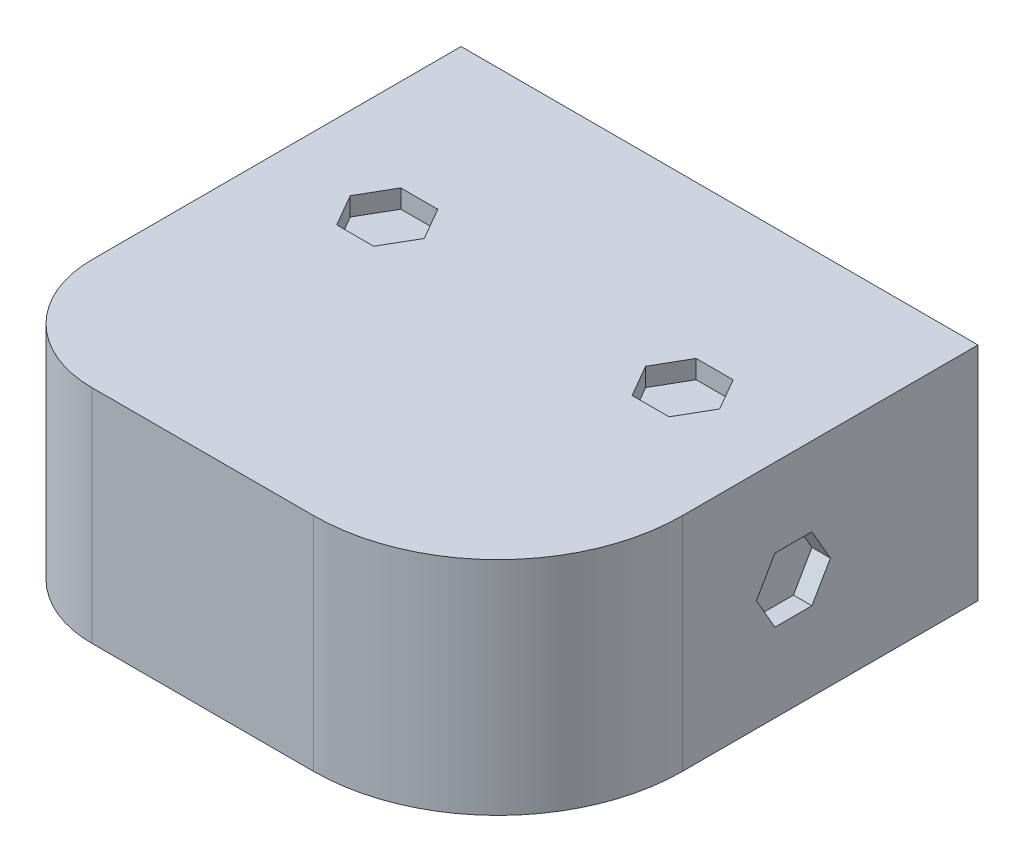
ISO-10303-21;
HEADER;
FILE_DESCRIPTION(('STEP AP214'),'2;1');
FILE_NAME('part.step','',(''),(''),'','','');
FILE_SCHEMA(('AUTOMOTIVE_DESIGN { 1 0 10303 214 1 1 1 1 }'));
ENDSEC;
DATA;
#1=APPLICATION_CONTEXT('core data for automotive mechanical design processes');
#2=APPLICATION_PROTOCOL_DEFINITION('international standard','automotive_design',2000,#1);
#3=PRODUCT_CONTEXT('',#1,'mechanical');
#4=PRODUCT('Part','Part','',(#3));
#5=PRODUCT_RELATED_PRODUCT_CATEGORY('part','',(#4));
#6=PRODUCT_DEFINITION_FORMATION('','',#4);
#7=PRODUCT_DEFINITION_CONTEXT('part definition',#1,'design');
#8=PRODUCT_DEFINITION('design','',#6,#7);
#9=PRODUCT_DEFINITION_SHAPE('','',#8);
#10=(LENGTH_UNIT() NAMED_UNIT(*) SI_UNIT(.MILLI.,.METRE.));
#11=(NAMED_UNIT(*) PLANE_ANGLE_UNIT() SI_UNIT($,.RADIAN.));
#12=(NAMED_UNIT(*) SI_UNIT($,.STERADIAN.) SOLID_ANGLE_UNIT());
#13=UNCERTAINTY_MEASURE_WITH_UNIT(LENGTH_MEASURE(1.E-05),#10,'distance_accuracy_value','');
#14=(GEOMETRIC_REPRESENTATION_CONTEXT(3) GLOBAL_UNCERTAINTY_ASSIGNED_CONTEXT((#13)) GLOBAL_UNIT_ASSIGNED_CONTEXT((#10,
#11,#12)) REPRESENTATION_CONTEXT('',''));
#15=CARTESIAN_POINT('',(0.,0.,0.));
#16=DIRECTION('',(0.,0.,1.));
#17=DIRECTION('',(1.,0.,0.));
#18=AXIS2_PLACEMENT_3D('',#15,#16,#17);
#19=CARTESIAN_POINT('',(88.9,38.1,-31.7500000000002));
#20=DIRECTION('',(-1.,0.,0.));
#21=DIRECTION('',(0.,0.,1.));
#22=AXIS2_PLACEMENT_3D('',#19,#20,#21);
#23=PLANE('',#22);
#24=DIRECTION('',(0.,-0.866025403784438,-0.500000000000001));
#25=VECTOR('',#24,1.);
#26=CARTESIAN_POINT('',(88.9,19.05,-44.4355215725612));
#27=LINE('',#26,#25);
#28=CARTESIAN_POINT('',(88.9,19.05,-44.4355215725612));
#29=VERTEX_POINT('',#28);
#30=CARTESIAN_POINT('',(88.9,13.5382,-47.6177607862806));
#31=VERTEX_POINT('',#30);
#32=EDGE_CURVE('E300',#29,#31,#27,.T.);
#33=ORIENTED_EDGE('',*,*,#32,.F.);
#34=DIRECTION('',(0.,-0.866025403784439,0.5));
#35=VECTOR('',#34,1.);
#36=CARTESIAN_POINT('',(88.9,24.5618,-47.6177607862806));
#37=LINE('',#36,#35);
#38=CARTESIAN_POINT('',(88.9,24.5618,-47.6177607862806));
#39=VERTEX_POINT('',#38);
#40=EDGE_CURVE('E47',#39,#29,#37,.T.);
#41=ORIENTED_EDGE('',*,*,#40,.F.);
#42=DIRECTION('',(0.,0.,1.));
#43=VECTOR('',#42,1.);
#44=CARTESIAN_POINT('',(88.9,24.5618,-53.9822392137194));
#45=LINE('',#44,#43);
#46=CARTESIAN_POINT('',(88.9,24.5618,-53.9822392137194));
#47=VERTEX_POINT('',#46);
#48=EDGE_CURVE('E286',#47,#39,#45,.T.);
#49=ORIENTED_EDGE('',*,*,#48,.F.);
#50=DIRECTION('',(0.,0.866025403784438,0.500000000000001));
#51=VECTOR('',#50,1.);
#52=CARTESIAN_POINT('',(88.9,19.05,-57.1644784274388));
#53=LINE('',#52,#51);
#54=CARTESIAN_POINT('',(88.9,19.05,-57.1644784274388));
#55=VERTEX_POINT('',#54);
#56=EDGE_CURVE('E289',#55,#47,#53,.T.);
#57=ORIENTED_EDGE('',*,*,#56,.F.);
#58=DIRECTION('',(0.,0.866025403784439,-0.499999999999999));
#59=VECTOR('',#58,1.);
#60=CARTESIAN_POINT('',(88.9,13.5382,-53.9822392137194));
#61=LINE('',#60,#59);
#62=CARTESIAN_POINT('',(88.9,13.5382,-53.9822392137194));
#63=VERTEX_POINT('',#62);
#64=EDGE_CURVE('E305',#63,#55,#61,.T.);
#65=ORIENTED_EDGE('',*,*,#64,.F.);
#66=DIRECTION('',(0.,0.,-1.));
#67=VECTOR('',#66,1.);
#68=CARTESIAN_POINT('',(88.9,13.5382,-47.6177607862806));
#69=LINE('',#68,#67);
#70=EDGE_CURVE('E302',#31,#63,#69,.T.);
#71=ORIENTED_EDGE('',*,*,#70,.F.);
#72=EDGE_LOOP('',(#33,#41,#49,#57,#65,#71));
#73=FACE_BOUND('',#72,.T.);
#74=DIRECTION('',(0.,0.,-1.));
#75=VECTOR('',#74,1.);
#76=CARTESIAN_POINT('',(88.9,0.,-31.7500000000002));
#77=LINE('',#76,#75);
#78=CARTESIAN_POINT('',(88.9,0.,-31.7500000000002));
#79=VERTEX_POINT('',#78);
#80=CARTESIAN_POINT('',(88.9,0.,-82.55));
#81=VERTEX_POINT('',#80);
#82=EDGE_CURVE('E499',#79,#81,#77,.T.);
#83=ORIENTED_EDGE('',*,*,#82,.T.);
#84=DIRECTION('',(0.,-1.,0.));
#85=VECTOR('',#84,1.);
#86=CARTESIAN_POINT('',(88.9,38.1,-82.55));
#87=LINE('',#86,#85);
#88=CARTESIAN_POINT('',(88.9,38.1,-82.55));
#89=VERTEX_POINT('',#88);
#90=EDGE_CURVE('E11',#89,#81,#87,.T.);
#91=ORIENTED_EDGE('',*,*,#90,.F.);
#92=DIRECTION('',(0.,0.,-1.));
#93=VECTOR('',#92,1.);
#94=CARTESIAN_POINT('',(88.9,38.1,-31.7500000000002));
#95=LINE('',#94,#93);
#96=CARTESIAN_POINT('',(88.9,38.1,-31.7500000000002));
#97=VERTEX_POINT('',#96);
#98=EDGE_CURVE('E510',#97,#89,#95,.T.);
#99=ORIENTED_EDGE('',*,*,#98,.F.);
#100=DIRECTION('',(0.,-1.,0.));
#101=VECTOR('',#100,1.);
#102=CARTESIAN_POINT('',(88.9,38.1,-31.7500000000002));
#103=LINE('',#102,#101);
#104=EDGE_CURVE('E524',#97,#79,#103,.T.);
#105=ORIENTED_EDGE('',*,*,#104,.T.);
#106=EDGE_LOOP('',(#83,#91,#99,#105));
#107=FACE_BOUND('',#106,.T.);
#108=ADVANCED_FACE('F33',(#73,#107),#23,.F.);
#109=CARTESIAN_POINT('',(0.,38.1,-82.55));
#110=DIRECTION('',(0.,0.,1.));
#111=DIRECTION('',(1.,0.,0.));
#112=AXIS2_PLACEMENT_3D('',#109,#110,#111);
#113=PLANE('',#112);
#114=DIRECTION('',(-0.500000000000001,-0.866025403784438,0.));
#115=VECTOR('',#114,1.);
#116=CARTESIAN_POINT('',(76.2144784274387,17.1091239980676,-82.55));
#117=LINE('',#116,#115);
#118=CARTESIAN_POINT('',(76.2144784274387,17.1091239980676,-82.55));
#119=VERTEX_POINT('',#118);
#120=CARTESIAN_POINT('',(73.0322392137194,11.5973239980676,-82.55));
#121=VERTEX_POINT('',#120);
#122=EDGE_CURVE('E435',#119,#121,#117,.T.);
#123=ORIENTED_EDGE('',*,*,#122,.F.);
#124=DIRECTION('',(0.5,-0.866025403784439,0.));
#125=VECTOR('',#124,1.);
#126=CARTESIAN_POINT('',(73.0322392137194,22.6209239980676,-82.55));
#127=LINE('',#126,#125);
#128=CARTESIAN_POINT('',(73.0322392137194,22.6209239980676,-82.55));
#129=VERTEX_POINT('',#128);
#130=EDGE_CURVE('E403',#129,#119,#127,.T.);
#131=ORIENTED_EDGE('',*,*,#130,.F.);
#132=DIRECTION('',(1.,0.,0.));
#133=VECTOR('',#132,1.);
#134=CARTESIAN_POINT('',(66.6677607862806,22.6209239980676,-82.55));
#135=LINE('',#134,#133);
#136=CARTESIAN_POINT('',(66.6677607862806,22.6209239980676,-82.55));
#137=VERTEX_POINT('',#136);
#138=EDGE_CURVE('E418',#137,#129,#135,.T.);
#139=ORIENTED_EDGE('',*,*,#138,.F.);
#140=DIRECTION('',(0.500000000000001,0.866025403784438,0.));
#141=VECTOR('',#140,1.);
#142=CARTESIAN_POINT('',(63.4855215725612,17.1091239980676,-82.55));
#143=LINE('',#142,#141);
#144=CARTESIAN_POINT('',(63.4855215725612,17.1091239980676,-82.55));
#145=VERTEX_POINT('',#144);
#146=EDGE_CURVE('E444',#145,#137,#143,.T.);
#147=ORIENTED_EDGE('',*,*,#146,.F.);
#148=DIRECTION('',(-0.5,0.866025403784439,0.));
#149=VECTOR('',#148,1.);
#150=CARTESIAN_POINT('',(66.6677607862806,11.5973239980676,-82.55));
#151=LINE('',#150,#149);
#152=CARTESIAN_POINT('',(66.6677607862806,11.5973239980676,-82.55));
#153=VERTEX_POINT('',#152);
#154=EDGE_CURVE('E441',#153,#145,#151,.T.);
#155=ORIENTED_EDGE('',*,*,#154,.F.);
#156=DIRECTION('',(-1.,0.,0.));
#157=VECTOR('',#156,1.);
#158=CARTESIAN_POINT('',(73.0322392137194,11.5973239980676,-82.55));
#159=LINE('',#158,#157);
#160=EDGE_CURVE('E438',#121,#153,#159,.T.);
#161=ORIENTED_EDGE('',*,*,#160,.F.);
#162=EDGE_LOOP('',(#123,#131,#139,#147,#155,#161));
#163=FACE_BOUND('',#162,.T.);
#164=DIRECTION('',(-0.5,-0.866025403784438,0.));
#165=VECTOR('',#164,1.);
#166=CARTESIAN_POINT('',(25.4144784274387,18.1688897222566,-82.55));
#167=LINE('',#166,#165);
#168=CARTESIAN_POINT('',(25.4144784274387,18.1688897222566,-82.55));
#169=VERTEX_POINT('',#168);
#170=CARTESIAN_POINT('',(22.2322392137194,12.6570897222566,-82.55));
#171=VERTEX_POINT('',#170);
#172=EDGE_CURVE('E483',#169,#171,#167,.T.);
#173=ORIENTED_EDGE('',*,*,#172,.F.);
#174=DIRECTION('',(0.5,-0.866025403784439,0.));
#175=VECTOR('',#174,1.);
#176=CARTESIAN_POINT('',(22.2322392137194,23.6806897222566,-82.55));
#177=LINE('',#176,#175);
#178=CARTESIAN_POINT('',(22.2322392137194,23.6806897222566,-82.55));
#179=VERTEX_POINT('',#178);
#180=EDGE_CURVE('E451',#179,#169,#177,.T.);
#181=ORIENTED_EDGE('',*,*,#180,.F.);
#182=DIRECTION('',(1.,0.,0.));
#183=VECTOR('',#182,1.);
#184=CARTESIAN_POINT('',(15.8677607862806,23.6806897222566,-82.55));
#185=LINE('',#184,#183);
#186=CARTESIAN_POINT('',(15.8677607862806,23.6806897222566,-82.55));
#187=VERTEX_POINT('',#186);
#188=EDGE_CURVE('E466',#187,#179,#185,.T.);
#189=ORIENTED_EDGE('',*,*,#188,.F.);
#190=DIRECTION('',(0.500000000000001,0.866025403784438,0.));
#191=VECTOR('',#190,1.);
#192=CARTESIAN_POINT('',(12.6855215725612,18.1688897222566,-82.55));
#193=LINE('',#192,#191);
#194=CARTESIAN_POINT('',(12.6855215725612,18.1688897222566,-82.55));
#195=VERTEX_POINT('',#194);
#196=EDGE_CURVE('E492',#195,#187,#193,.T.);
#197=ORIENTED_EDGE('',*,*,#196,.F.);
#198=DIRECTION('',(-0.5,0.866025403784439,0.));
#199=VECTOR('',#198,1.);
#200=CARTESIAN_POINT('',(15.8677607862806,12.6570897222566,-82.55));
#201=LINE('',#200,#199);
#202=CARTESIAN_POINT('',(15.8677607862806,12.6570897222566,-82.55));
#203=VERTEX_POINT('',#202);
#204=EDGE_CURVE('E489',#203,#195,#201,.T.);
#205=ORIENTED_EDGE('',*,*,#204,.F.);
#206=DIRECTION('',(-1.,0.,0.));
#207=VECTOR('',#206,1.);
#208=CARTESIAN_POINT('',(22.2322392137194,12.6570897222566,-82.55));
#209=LINE('',#208,#207);
#210=EDGE_CURVE('E486',#171,#203,#209,.T.);
#211=ORIENTED_EDGE('',*,*,#210,.F.);
#212=EDGE_LOOP('',(#173,#181,#189,#197,#205,#211));
#213=FACE_BOUND('',#212,.T.);
#214=DIRECTION('',(-1.,0.,0.));
#215=VECTOR('',#214,1.);
#216=CARTESIAN_POINT('',(0.,0.,-82.55));
#217=LINE('',#216,#215);
#218=CARTESIAN_POINT('',(0.,0.,-82.55));
#219=VERTEX_POINT('',#218);
#220=EDGE_CURVE('E527',#81,#219,#217,.T.);
#221=ORIENTED_EDGE('',*,*,#220,.T.);
#222=DIRECTION('',(0.,-1.,0.));
#223=VECTOR('',#222,1.);
#224=CARTESIAN_POINT('',(0.,38.1,-82.55));
#225=LINE('',#224,#223);
#226=CARTESIAN_POINT('',(0.,38.1,-82.55));
#227=VERTEX_POINT('',#226);
#228=EDGE_CURVE('E40',#227,#219,#225,.T.);
#229=ORIENTED_EDGE('',*,*,#228,.F.);
#230=DIRECTION('',(-1.,0.,0.));
#231=VECTOR('',#230,1.);
#232=CARTESIAN_POINT('',(0.,38.1,-82.55));
#233=LINE('',#232,#231);
#234=EDGE_CURVE('E513',#89,#227,#233,.T.);
#235=ORIENTED_EDGE('',*,*,#234,.F.);
#236=ORIENTED_EDGE('',*,*,#90,.T.);
#237=EDGE_LOOP('',(#221,#229,#235,#236));
#238=FACE_BOUND('',#237,.T.);
#239=ADVANCED_FACE('F574',(#163,#213,#238),#113,.F.);
#240=CARTESIAN_POINT('',(0.,38.1,-19.0500000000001));
#241=DIRECTION('',(1.,0.,0.));
#242=DIRECTION('',(0.,0.,-1.));
#243=AXIS2_PLACEMENT_3D('',#240,#241,#242);
#244=PLANE('',#243);
#245=DIRECTION('',(0.,0.,1.));
#246=VECTOR('',#245,1.);
#247=CARTESIAN_POINT('',(0.,0.,-19.0500000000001));
#248=LINE('',#247,#246);
#249=CARTESIAN_POINT('',(0.,0.,-19.0500000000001));
#250=VERTEX_POINT('',#249);
#251=EDGE_CURVE('E529',#219,#250,#248,.T.);
#252=ORIENTED_EDGE('',*,*,#251,.T.);
#253=DIRECTION('',(0.,-1.,0.));
#254=VECTOR('',#253,1.);
#255=CARTESIAN_POINT('',(0.,38.1,-19.0500000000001));
#256=LINE('',#255,#254);
#257=CARTESIAN_POINT('',(0.,38.1,-19.0500000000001));
#258=VERTEX_POINT('',#257);
#259=EDGE_CURVE('E544',#258,#250,#256,.T.);
#260=ORIENTED_EDGE('',*,*,#259,.F.);
#261=DIRECTION('',(0.,0.,1.));
#262=VECTOR('',#261,1.);
#263=CARTESIAN_POINT('',(0.,38.1,-19.0500000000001));
#264=LINE('',#263,#262);
#265=EDGE_CURVE('E516',#227,#258,#264,.T.);
#266=ORIENTED_EDGE('',*,*,#265,.F.);
#267=ORIENTED_EDGE('',*,*,#228,.T.);
#268=EDGE_LOOP('',(#252,#260,#266,#267));
#269=FACE_BOUND('',#268,.T.);
#270=ADVANCED_FACE('F551',(#269),#244,.F.);
#271=CARTESIAN_POINT('',(19.05,38.1,-19.05));
#272=DIRECTION('',(0.,-1.,0.));
#273=DIRECTION('',(0.,0.,-1.));
#274=AXIS2_PLACEMENT_3D('',#271,#272,#273);
#275=CYLINDRICAL_SURFACE('',#274,19.05);
#276=CARTESIAN_POINT('',(19.05,0.,-19.05));
#277=DIRECTION('',(0.,1.,0.));
#278=DIRECTION('',(0.,0.,1.));
#279=AXIS2_PLACEMENT_3D('',#276,#277,#278);
#280=CIRCLE('',#279,19.05);
#281=CARTESIAN_POINT('',(19.0500000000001,0.,0.));
#282=VERTEX_POINT('',#281);
#283=EDGE_CURVE('E531',#250,#282,#280,.T.);
#284=ORIENTED_EDGE('',*,*,#283,.T.);
#285=DIRECTION('',(0.,-1.,0.));
#286=VECTOR('',#285,1.);
#287=CARTESIAN_POINT('',(19.0500000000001,38.1,0.));
#288=LINE('',#287,#286);
#289=CARTESIAN_POINT('',(19.0500000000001,38.1,0.));
#290=VERTEX_POINT('',#289);
#291=EDGE_CURVE('E541',#290,#282,#288,.T.);
#292=ORIENTED_EDGE('',*,*,#291,.F.);
#293=CARTESIAN_POINT('',(19.05,38.1,-19.05));
#294=DIRECTION('',(0.,1.,0.));
#295=DIRECTION('',(0.,0.,1.));
#296=AXIS2_PLACEMENT_3D('',#293,#294,#295);
#297=CIRCLE('',#296,19.05);
#298=EDGE_CURVE('E518',#258,#290,#297,.T.);
#299=ORIENTED_EDGE('',*,*,#298,.F.);
#300=ORIENTED_EDGE('',*,*,#259,.T.);
#301=EDGE_LOOP('',(#284,#292,#299,#300));
#302=FACE_BOUND('',#301,.T.);
#303=ADVANCED_FACE('F562',(#302),#275,.T.);
#304=CARTESIAN_POINT('',(19.0500000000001,38.1,0.));
#305=DIRECTION('',(0.,0.,-1.));
#306=DIRECTION('',(-1.,0.,0.));
#307=AXIS2_PLACEMENT_3D('',#304,#305,#306);
#308=PLANE('',#307);
#309=DIRECTION('',(1.,0.,0.));
#310=VECTOR('',#309,1.);
#311=CARTESIAN_POINT('',(19.0500000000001,0.,0.));
#312=LINE('',#311,#310);
#313=CARTESIAN_POINT('',(57.1499999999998,0.,0.));
#314=VERTEX_POINT('',#313);
#315=EDGE_CURVE('E533',#282,#314,#312,.T.);
#316=ORIENTED_EDGE('',*,*,#315,.T.);
#317=DIRECTION('',(0.,-1.,0.));
#318=VECTOR('',#317,1.);
#319=CARTESIAN_POINT('',(57.1499999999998,38.1,0.));
#320=LINE('',#319,#318);
#321=CARTESIAN_POINT('',(57.1499999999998,38.1,0.));
#322=VERTEX_POINT('',#321);
#323=EDGE_CURVE('E538',#322,#314,#320,.T.);
#324=ORIENTED_EDGE('',*,*,#323,.F.);
#325=DIRECTION('',(1.,0.,0.));
#326=VECTOR('',#325,1.);
#327=CARTESIAN_POINT('',(19.0500000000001,38.1,0.));
#328=LINE('',#327,#326);
#329=EDGE_CURVE('E520',#290,#322,#328,.T.);
#330=ORIENTED_EDGE('',*,*,#329,.F.);
#331=ORIENTED_EDGE('',*,*,#291,.T.);
#332=EDGE_LOOP('',(#316,#324,#330,#331));
#333=FACE_BOUND('',#332,.T.);
#334=ADVANCED_FACE('F566',(#333),#308,.F.);
#335=CARTESIAN_POINT('',(57.15,38.1,-31.75));
#336=DIRECTION('',(0.,-1.,0.));
#337=DIRECTION('',(0.,0.,-1.));
#338=AXIS2_PLACEMENT_3D('',#335,#336,#337);
#339=CYLINDRICAL_SURFACE('',#338,31.75);
#340=CARTESIAN_POINT('',(57.15,0.,-31.75));
#341=DIRECTION('',(0.,1.,0.));
#342=DIRECTION('',(0.,0.,-1.));
#343=AXIS2_PLACEMENT_3D('',#340,#341,#342);
#344=CIRCLE('',#343,31.75);
#345=EDGE_CURVE('E514',#314,#79,#344,.T.);
#346=ORIENTED_EDGE('',*,*,#345,.T.);
#347=ORIENTED_EDGE('',*,*,#104,.F.);
#348=CARTESIAN_POINT('',(57.15,38.1,-31.75));
#349=DIRECTION('',(0.,1.,0.));
#350=DIRECTION('',(0.,0.,-1.));
#351=AXIS2_PLACEMENT_3D('',#348,#349,#350);
#352=CIRCLE('',#351,31.75);
#353=EDGE_CURVE('E522',#322,#97,#352,.T.);
#354=ORIENTED_EDGE('',*,*,#353,.F.);
#355=ORIENTED_EDGE('',*,*,#323,.T.);
#356=EDGE_LOOP('',(#346,#347,#354,#355));
#357=FACE_BOUND('',#356,.T.);
#358=ADVANCED_FACE('F577',(#357),#339,.T.);
#359=CARTESIAN_POINT('',(19.05,38.1,-19.05));
#360=DIRECTION('',(0.,1.,0.));
#361=DIRECTION('',(0.,0.,1.));
#362=AXIS2_PLACEMENT_3D('',#359,#360,#361);
#363=PLANE('',#362);
#364=DIRECTION('',(-0.5,0.,0.866025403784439));
#365=VECTOR('',#364,1.);
#366=CARTESIAN_POINT('',(15.8677607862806,38.1,-56.3118));
#367=LINE('',#366,#365);
#368=CARTESIAN_POINT('',(15.8677607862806,38.1,-56.3118));
#369=VERTEX_POINT('',#368);
#370=CARTESIAN_POINT('',(12.6855215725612,38.1,-50.8));
#371=VERTEX_POINT('',#370);
#372=EDGE_CURVE('E55',#369,#371,#367,.T.);
#373=ORIENTED_EDGE('',*,*,#372,.F.);
#374=DIRECTION('',(-1.,0.,0.));
#375=VECTOR('',#374,1.);
#376=CARTESIAN_POINT('',(22.2322392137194,38.1,-56.3118));
#377=LINE('',#376,#375);
#378=CARTESIAN_POINT('',(22.2322392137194,38.1,-56.3118));
#379=VERTEX_POINT('',#378);
#380=EDGE_CURVE('E323',#379,#369,#377,.T.);
#381=ORIENTED_EDGE('',*,*,#380,.F.);
#382=DIRECTION('',(-0.500000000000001,0.,-0.866025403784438));
#383=VECTOR('',#382,1.);
#384=CARTESIAN_POINT('',(25.4144784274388,38.1,-50.8));
#385=LINE('',#384,#383);
#386=CARTESIAN_POINT('',(25.4144784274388,38.1,-50.8));
#387=VERTEX_POINT('',#386);
#388=EDGE_CURVE('E349',#387,#379,#385,.T.);
#389=ORIENTED_EDGE('',*,*,#388,.F.);
#390=DIRECTION('',(0.499999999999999,0.,-0.866025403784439));
#391=VECTOR('',#390,1.);
#392=CARTESIAN_POINT('',(22.2322392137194,38.1,-45.2882));
#393=LINE('',#392,#391);
#394=CARTESIAN_POINT('',(22.2322392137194,38.1,-45.2882));
#395=VERTEX_POINT('',#394);
#396=EDGE_CURVE('E346',#395,#387,#393,.T.);
#397=ORIENTED_EDGE('',*,*,#396,.F.);
#398=DIRECTION('',(1.,0.,0.));
#399=VECTOR('',#398,1.);
#400=CARTESIAN_POINT('',(15.8677607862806,38.1,-45.2882));
#401=LINE('',#400,#399);
#402=CARTESIAN_POINT('',(15.8677607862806,38.1,-45.2882));
#403=VERTEX_POINT('',#402);
#404=EDGE_CURVE('E343',#403,#395,#401,.T.);
#405=ORIENTED_EDGE('',*,*,#404,.F.);
#406=DIRECTION('',(0.500000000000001,0.,0.866025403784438));
#407=VECTOR('',#406,1.);
#408=CARTESIAN_POINT('',(12.6855215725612,38.1,-50.8));
#409=LINE('',#408,#407);
#410=EDGE_CURVE('E340',#371,#403,#409,.T.);
#411=ORIENTED_EDGE('',*,*,#410,.F.);
#412=EDGE_LOOP('',(#373,#381,#389,#397,#405,#411));
#413=FACE_BOUND('',#412,.T.);
#414=DIRECTION('',(-0.5,0.,0.866025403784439));
#415=VECTOR('',#414,1.);
#416=CARTESIAN_POINT('',(66.6677607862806,38.1,-56.3118));
#417=LINE('',#416,#415);
#418=CARTESIAN_POINT('',(66.6677607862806,38.1,-56.3118));
#419=VERTEX_POINT('',#418);
#420=CARTESIAN_POINT('',(63.4855215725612,38.1,-50.8));
#421=VERTEX_POINT('',#420);
#422=EDGE_CURVE('E356',#419,#421,#417,.T.);
#423=ORIENTED_EDGE('',*,*,#422,.F.);
#424=DIRECTION('',(-1.,0.,0.));
#425=VECTOR('',#424,1.);
#426=CARTESIAN_POINT('',(73.0322392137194,38.1,-56.3118));
#427=LINE('',#426,#425);
#428=CARTESIAN_POINT('',(73.0322392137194,38.1,-56.3118));
#429=VERTEX_POINT('',#428);
#430=EDGE_CURVE('E370',#429,#419,#427,.T.);
#431=ORIENTED_EDGE('',*,*,#430,.F.);
#432=DIRECTION('',(-0.500000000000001,0.,-0.866025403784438));
#433=VECTOR('',#432,1.);
#434=CARTESIAN_POINT('',(76.2144784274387,38.1,-50.8));
#435=LINE('',#434,#433);
#436=CARTESIAN_POINT('',(76.2144784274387,38.1,-50.8));
#437=VERTEX_POINT('',#436);
#438=EDGE_CURVE('E396',#437,#429,#435,.T.);
#439=ORIENTED_EDGE('',*,*,#438,.F.);
#440=DIRECTION('',(0.499999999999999,0.,-0.866025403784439));
#441=VECTOR('',#440,1.);
#442=CARTESIAN_POINT('',(73.0322392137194,38.1,-45.2882));
#443=LINE('',#442,#441);
#444=CARTESIAN_POINT('',(73.0322392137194,38.1,-45.2882));
#445=VERTEX_POINT('',#444);
#446=EDGE_CURVE('E393',#445,#437,#443,.T.);
#447=ORIENTED_EDGE('',*,*,#446,.F.);
#448=DIRECTION('',(1.,0.,0.));
#449=VECTOR('',#448,1.);
#450=CARTESIAN_POINT('',(66.6677607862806,38.1,-45.2882));
#451=LINE('',#450,#449);
#452=CARTESIAN_POINT('',(66.6677607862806,38.1,-45.2882));
#453=VERTEX_POINT('',#452);
#454=EDGE_CURVE('E390',#453,#445,#451,.T.);
#455=ORIENTED_EDGE('',*,*,#454,.F.);
#456=DIRECTION('',(0.500000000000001,0.,0.866025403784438));
#457=VECTOR('',#456,1.);
#458=CARTESIAN_POINT('',(63.4855215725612,38.1,-50.8));
#459=LINE('',#458,#457);
#460=EDGE_CURVE('E387',#421,#453,#459,.T.);
#461=ORIENTED_EDGE('',*,*,#460,.F.);
#462=EDGE_LOOP('',(#423,#431,#439,#447,#455,#461));
#463=FACE_BOUND('',#462,.T.);
#464=ORIENTED_EDGE('',*,*,#98,.T.);
#465=ORIENTED_EDGE('',*,*,#234,.T.);
#466=ORIENTED_EDGE('',*,*,#265,.T.);
#467=ORIENTED_EDGE('',*,*,#298,.T.);
#468=ORIENTED_EDGE('',*,*,#329,.T.);
#469=ORIENTED_EDGE('',*,*,#353,.T.);
#470=EDGE_LOOP('',(#464,#465,#466,#467,#468,#469));
#471=FACE_BOUND('',#470,.T.);
#472=ADVANCED_FACE('F570',(#413,#463,#471),#363,.T.);
#473=CARTESIAN_POINT('',(19.05,0.,-19.05));
#474=DIRECTION('',(0.,1.,0.));
#475=DIRECTION('',(0.,0.,1.));
#476=AXIS2_PLACEMENT_3D('',#473,#474,#475);
#477=PLANE('',#476);
#478=ORIENTED_EDGE('',*,*,#82,.F.);
#479=ORIENTED_EDGE('',*,*,#345,.F.);
#480=ORIENTED_EDGE('',*,*,#315,.F.);
#481=ORIENTED_EDGE('',*,*,#283,.F.);
#482=ORIENTED_EDGE('',*,*,#251,.F.);
#483=ORIENTED_EDGE('',*,*,#220,.F.);
#484=EDGE_LOOP('',(#478,#479,#480,#481,#482,#483));
#485=FACE_BOUND('',#484,.T.);
#486=ADVANCED_FACE('F557',(#485),#477,.F.);
#487=CARTESIAN_POINT('',(22.2322392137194,23.6806897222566,-79.375));
#488=DIRECTION('',(0.866025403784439,0.5,0.));
#489=DIRECTION('',(-0.5,0.866025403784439,0.));
#490=AXIS2_PLACEMENT_3D('',#487,#488,#489);
#491=PLANE('',#490);
#492=ORIENTED_EDGE('',*,*,#180,.T.);
#493=DIRECTION('',(0.,0.,-1.));
#494=VECTOR('',#493,1.);
#495=CARTESIAN_POINT('',(25.4144784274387,18.1688897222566,-79.375));
#496=LINE('',#495,#494);
#497=CARTESIAN_POINT('',(25.4144784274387,18.1688897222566,-79.375));
#498=VERTEX_POINT('',#497);
#499=EDGE_CURVE('E481',#498,#169,#496,.T.);
#500=ORIENTED_EDGE('',*,*,#499,.F.);
#501=DIRECTION('',(0.5,-0.866025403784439,0.));
#502=VECTOR('',#501,1.);
#503=CARTESIAN_POINT('',(22.2322392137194,23.6806897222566,-79.375));
#504=LINE('',#503,#502);
#505=CARTESIAN_POINT('',(22.2322392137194,23.6806897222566,-79.375));
#506=VERTEX_POINT('',#505);
#507=EDGE_CURVE('E462',#506,#498,#504,.T.);
#508=ORIENTED_EDGE('',*,*,#507,.F.);
#509=DIRECTION('',(0.,0.,-1.));
#510=VECTOR('',#509,1.);
#511=CARTESIAN_POINT('',(22.2322392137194,23.6806897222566,-79.375));
#512=LINE('',#511,#510);
#513=EDGE_CURVE('E497',#506,#179,#512,.T.);
#514=ORIENTED_EDGE('',*,*,#513,.T.);
#515=EDGE_LOOP('',(#492,#500,#508,#514));
#516=FACE_BOUND('',#515,.T.);
#517=ADVANCED_FACE('F719',(#516),#491,.F.);
#518=CARTESIAN_POINT('',(15.8677607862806,23.6806897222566,-79.375));
#519=DIRECTION('',(0.,1.,0.));
#520=DIRECTION('',(0.,0.,1.));
#521=AXIS2_PLACEMENT_3D('',#518,#519,#520);
#522=PLANE('',#521);
#523=ORIENTED_EDGE('',*,*,#188,.T.);
#524=ORIENTED_EDGE('',*,*,#513,.F.);
#525=DIRECTION('',(1.,0.,0.));
#526=VECTOR('',#525,1.);
#527=CARTESIAN_POINT('',(15.8677607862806,23.6806897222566,-79.375));
#528=LINE('',#527,#526);
#529=CARTESIAN_POINT('',(15.8677607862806,23.6806897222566,-79.375));
#530=VERTEX_POINT('',#529);
#531=EDGE_CURVE('E478',#530,#506,#528,.T.);
#532=ORIENTED_EDGE('',*,*,#531,.F.);
#533=DIRECTION('',(0.,0.,-1.));
#534=VECTOR('',#533,1.);
#535=CARTESIAN_POINT('',(15.8677607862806,23.6806897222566,-79.375));
#536=LINE('',#535,#534);
#537=EDGE_CURVE('E500',#530,#187,#536,.T.);
#538=ORIENTED_EDGE('',*,*,#537,.T.);
#539=EDGE_LOOP('',(#523,#524,#532,#538));
#540=FACE_BOUND('',#539,.T.);
#541=ADVANCED_FACE('F715',(#540),#522,.F.);
#542=CARTESIAN_POINT('',(12.6855215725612,18.1688897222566,-79.375));
#543=DIRECTION('',(-0.866025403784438,0.500000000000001,0.));
#544=DIRECTION('',(-0.500000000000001,-0.866025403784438,0.));
#545=AXIS2_PLACEMENT_3D('',#542,#543,#544);
#546=PLANE('',#545);
#547=ORIENTED_EDGE('',*,*,#196,.T.);
#548=ORIENTED_EDGE('',*,*,#537,.F.);
#549=DIRECTION('',(0.500000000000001,0.866025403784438,0.));
#550=VECTOR('',#549,1.);
#551=CARTESIAN_POINT('',(12.6855215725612,18.1688897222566,-79.375));
#552=LINE('',#551,#550);
#553=CARTESIAN_POINT('',(12.6855215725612,18.1688897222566,-79.375));
#554=VERTEX_POINT('',#553);
#555=EDGE_CURVE('E475',#554,#530,#552,.T.);
#556=ORIENTED_EDGE('',*,*,#555,.F.);
#557=DIRECTION('',(0.,0.,-1.));
#558=VECTOR('',#557,1.);
#559=CARTESIAN_POINT('',(12.6855215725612,18.1688897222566,-79.375));
#560=LINE('',#559,#558);
#561=EDGE_CURVE('E502',#554,#195,#560,.T.);
#562=ORIENTED_EDGE('',*,*,#561,.T.);
#563=EDGE_LOOP('',(#547,#548,#556,#562));
#564=FACE_BOUND('',#563,.T.);
#565=ADVANCED_FACE('F718',(#564),#546,.F.);
#566=CARTESIAN_POINT('',(15.8677607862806,12.6570897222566,-79.375));
#567=DIRECTION('',(-0.866025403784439,-0.5,0.));
#568=DIRECTION('',(0.5,-0.866025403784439,0.));
#569=AXIS2_PLACEMENT_3D('',#566,#567,#568);
#570=PLANE('',#569);
#571=ORIENTED_EDGE('',*,*,#204,.T.);
#572=ORIENTED_EDGE('',*,*,#561,.F.);
#573=DIRECTION('',(-0.5,0.866025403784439,0.));
#574=VECTOR('',#573,1.);
#575=CARTESIAN_POINT('',(15.8677607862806,12.6570897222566,-79.375));
#576=LINE('',#575,#574);
#577=CARTESIAN_POINT('',(15.8677607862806,12.6570897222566,-79.375));
#578=VERTEX_POINT('',#577);
#579=EDGE_CURVE('E472',#578,#554,#576,.T.);
#580=ORIENTED_EDGE('',*,*,#579,.F.);
#581=DIRECTION('',(0.,0.,-1.));
#582=VECTOR('',#581,1.);
#583=CARTESIAN_POINT('',(15.8677607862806,12.6570897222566,-79.375));
#584=LINE('',#583,#582);
#585=EDGE_CURVE('E504',#578,#203,#584,.T.);
#586=ORIENTED_EDGE('',*,*,#585,.T.);
#587=EDGE_LOOP('',(#571,#572,#580,#586));
#588=FACE_BOUND('',#587,.T.);
#589=ADVANCED_FACE('F723',(#588),#570,.F.);
#590=CARTESIAN_POINT('',(22.2322392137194,12.6570897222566,-79.375));
#591=DIRECTION('',(0.,-1.,0.));
#592=DIRECTION('',(0.,0.,-1.));
#593=AXIS2_PLACEMENT_3D('',#590,#591,#592);
#594=PLANE('',#593);
#595=ORIENTED_EDGE('',*,*,#210,.T.);
#596=ORIENTED_EDGE('',*,*,#585,.F.);
#597=DIRECTION('',(-1.,0.,0.));
#598=VECTOR('',#597,1.);
#599=CARTESIAN_POINT('',(22.2322392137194,12.6570897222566,-79.375));
#600=LINE('',#599,#598);
#601=CARTESIAN_POINT('',(22.2322392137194,12.6570897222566,-79.375));
#602=VERTEX_POINT('',#601);
#603=EDGE_CURVE('E469',#602,#578,#600,.T.);
#604=ORIENTED_EDGE('',*,*,#603,.F.);
#605=DIRECTION('',(0.,0.,-1.));
#606=VECTOR('',#605,1.);
#607=CARTESIAN_POINT('',(22.2322392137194,12.6570897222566,-79.375));
#608=LINE('',#607,#606);
#609=EDGE_CURVE('E506',#602,#171,#608,.T.);
#610=ORIENTED_EDGE('',*,*,#609,.T.);
#611=EDGE_LOOP('',(#595,#596,#604,#610));
#612=FACE_BOUND('',#611,.T.);
#613=ADVANCED_FACE('F727',(#612),#594,.F.);
#614=CARTESIAN_POINT('',(25.4144784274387,18.1688897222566,-79.375));
#615=DIRECTION('',(0.866025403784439,-0.5,0.));
#616=DIRECTION('',(0.5,0.866025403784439,0.));
#617=AXIS2_PLACEMENT_3D('',#614,#615,#616);
#618=PLANE('',#617);
#619=ORIENTED_EDGE('',*,*,#172,.T.);
#620=ORIENTED_EDGE('',*,*,#609,.F.);
#621=DIRECTION('',(-0.5,-0.866025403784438,0.));
#622=VECTOR('',#621,1.);
#623=CARTESIAN_POINT('',(25.4144784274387,18.1688897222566,-79.375));
#624=LINE('',#623,#622);
#625=EDGE_CURVE('E465',#498,#602,#624,.T.);
#626=ORIENTED_EDGE('',*,*,#625,.F.);
#627=ORIENTED_EDGE('',*,*,#499,.T.);
#628=EDGE_LOOP('',(#619,#620,#626,#627));
#629=FACE_BOUND('',#628,.T.);
#630=ADVANCED_FACE('F713',(#629),#618,.F.);
#631=CARTESIAN_POINT('',(25.4144784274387,18.1688897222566,-79.375));
#632=DIRECTION('',(0.,0.,-1.));
#633=DIRECTION('',(-1.,0.,0.));
#634=AXIS2_PLACEMENT_3D('',#631,#632,#633);
#635=PLANE('',#634);
#636=ORIENTED_EDGE('',*,*,#507,.T.);
#637=ORIENTED_EDGE('',*,*,#625,.T.);
#638=ORIENTED_EDGE('',*,*,#603,.T.);
#639=ORIENTED_EDGE('',*,*,#579,.T.);
#640=ORIENTED_EDGE('',*,*,#555,.T.);
#641=ORIENTED_EDGE('',*,*,#531,.T.);
#642=EDGE_LOOP('',(#636,#637,#638,#639,#640,#641));
#643=FACE_BOUND('',#642,.T.);
#644=ADVANCED_FACE('F709',(#643),#635,.T.);
#645=CARTESIAN_POINT('',(73.0322392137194,22.6209239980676,-79.375));
#646=DIRECTION('',(0.866025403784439,0.5,0.));
#647=DIRECTION('',(-0.5,0.866025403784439,0.));
#648=AXIS2_PLACEMENT_3D('',#645,#646,#647);
#649=PLANE('',#648);
#650=ORIENTED_EDGE('',*,*,#130,.T.);
#651=DIRECTION('',(0.,0.,-1.));
#652=VECTOR('',#651,1.);
#653=CARTESIAN_POINT('',(76.2144784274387,17.1091239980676,-79.375));
#654=LINE('',#653,#652);
#655=CARTESIAN_POINT('',(76.2144784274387,17.1091239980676,-79.375));
#656=VERTEX_POINT('',#655);
#657=EDGE_CURVE('E433',#656,#119,#654,.T.);
#658=ORIENTED_EDGE('',*,*,#657,.F.);
#659=DIRECTION('',(0.5,-0.866025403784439,0.));
#660=VECTOR('',#659,1.);
#661=CARTESIAN_POINT('',(73.0322392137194,22.6209239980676,-79.375));
#662=LINE('',#661,#660);
#663=CARTESIAN_POINT('',(73.0322392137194,22.6209239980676,-79.375));
#664=VERTEX_POINT('',#663);
#665=EDGE_CURVE('E414',#664,#656,#662,.T.);
#666=ORIENTED_EDGE('',*,*,#665,.F.);
#667=DIRECTION('',(0.,0.,-1.));
#668=VECTOR('',#667,1.);
#669=CARTESIAN_POINT('',(73.0322392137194,22.6209239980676,-79.375));
#670=LINE('',#669,#668);
#671=EDGE_CURVE('E449',#664,#129,#670,.T.);
#672=ORIENTED_EDGE('',*,*,#671,.T.);
#673=EDGE_LOOP('',(#650,#658,#666,#672));
#674=FACE_BOUND('',#673,.T.);
#675=ADVANCED_FACE('F691',(#674),#649,.F.);
#676=CARTESIAN_POINT('',(66.6677607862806,22.6209239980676,-79.375));
#677=DIRECTION('',(0.,1.,0.));
#678=DIRECTION('',(0.,0.,1.));
#679=AXIS2_PLACEMENT_3D('',#676,#677,#678);
#680=PLANE('',#679);
#681=ORIENTED_EDGE('',*,*,#138,.T.);
#682=ORIENTED_EDGE('',*,*,#671,.F.);
#683=DIRECTION('',(1.,0.,0.));
#684=VECTOR('',#683,1.);
#685=CARTESIAN_POINT('',(66.6677607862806,22.6209239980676,-79.375));
#686=LINE('',#685,#684);
#687=CARTESIAN_POINT('',(66.6677607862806,22.6209239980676,-79.375));
#688=VERTEX_POINT('',#687);
#689=EDGE_CURVE('E430',#688,#664,#686,.T.);
#690=ORIENTED_EDGE('',*,*,#689,.F.);
#691=DIRECTION('',(0.,0.,-1.));
#692=VECTOR('',#691,1.);
#693=CARTESIAN_POINT('',(66.6677607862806,22.6209239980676,-79.375));
#694=LINE('',#693,#692);
#695=EDGE_CURVE('E452',#688,#137,#694,.T.);
#696=ORIENTED_EDGE('',*,*,#695,.T.);
#697=EDGE_LOOP('',(#681,#682,#690,#696));
#698=FACE_BOUND('',#697,.T.);
#699=ADVANCED_FACE('F687',(#698),#680,.F.);
#700=CARTESIAN_POINT('',(63.4855215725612,17.1091239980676,-79.375));
#701=DIRECTION('',(-0.866025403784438,0.500000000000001,0.));
#702=DIRECTION('',(-0.500000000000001,-0.866025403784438,0.));
#703=AXIS2_PLACEMENT_3D('',#700,#701,#702);
#704=PLANE('',#703);
#705=ORIENTED_EDGE('',*,*,#146,.T.);
#706=ORIENTED_EDGE('',*,*,#695,.F.);
#707=DIRECTION('',(0.500000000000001,0.866025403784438,0.));
#708=VECTOR('',#707,1.);
#709=CARTESIAN_POINT('',(63.4855215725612,17.1091239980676,-79.375));
#710=LINE('',#709,#708);
#711=CARTESIAN_POINT('',(63.4855215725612,17.1091239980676,-79.375));
#712=VERTEX_POINT('',#711);
#713=EDGE_CURVE('E427',#712,#688,#710,.T.);
#714=ORIENTED_EDGE('',*,*,#713,.F.);
#715=DIRECTION('',(0.,0.,-1.));
#716=VECTOR('',#715,1.);
#717=CARTESIAN_POINT('',(63.4855215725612,17.1091239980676,-79.375));
#718=LINE('',#717,#716);
#719=EDGE_CURVE('E454',#712,#145,#718,.T.);
#720=ORIENTED_EDGE('',*,*,#719,.T.);
#721=EDGE_LOOP('',(#705,#706,#714,#720));
#722=FACE_BOUND('',#721,.T.);
#723=ADVANCED_FACE('F690',(#722),#704,.F.);
#724=CARTESIAN_POINT('',(66.6677607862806,11.5973239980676,-79.375));
#725=DIRECTION('',(-0.866025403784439,-0.5,0.));
#726=DIRECTION('',(0.5,-0.866025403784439,0.));
#727=AXIS2_PLACEMENT_3D('',#724,#725,#726);
#728=PLANE('',#727);
#729=ORIENTED_EDGE('',*,*,#154,.T.);
#730=ORIENTED_EDGE('',*,*,#719,.F.);
#731=DIRECTION('',(-0.5,0.866025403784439,0.));
#732=VECTOR('',#731,1.);
#733=CARTESIAN_POINT('',(66.6677607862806,11.5973239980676,-79.375));
#734=LINE('',#733,#732);
#735=CARTESIAN_POINT('',(66.6677607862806,11.5973239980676,-79.375));
#736=VERTEX_POINT('',#735);
#737=EDGE_CURVE('E424',#736,#712,#734,.T.);
#738=ORIENTED_EDGE('',*,*,#737,.F.);
#739=DIRECTION('',(0.,0.,-1.));
#740=VECTOR('',#739,1.);
#741=CARTESIAN_POINT('',(66.6677607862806,11.5973239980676,-79.375));
#742=LINE('',#741,#740);
#743=EDGE_CURVE('E456',#736,#153,#742,.T.);
#744=ORIENTED_EDGE('',*,*,#743,.T.);
#745=EDGE_LOOP('',(#729,#730,#738,#744));
#746=FACE_BOUND('',#745,.T.);
#747=ADVANCED_FACE('F695',(#746),#728,.F.);
#748=CARTESIAN_POINT('',(73.0322392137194,11.5973239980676,-79.375));
#749=DIRECTION('',(0.,-1.,0.));
#750=DIRECTION('',(0.,0.,-1.));
#751=AXIS2_PLACEMENT_3D('',#748,#749,#750);
#752=PLANE('',#751);
#753=ORIENTED_EDGE('',*,*,#160,.T.);
#754=ORIENTED_EDGE('',*,*,#743,.F.);
#755=DIRECTION('',(-1.,0.,0.));
#756=VECTOR('',#755,1.);
#757=CARTESIAN_POINT('',(73.0322392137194,11.5973239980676,-79.375));
#758=LINE('',#757,#756);
#759=CARTESIAN_POINT('',(73.0322392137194,11.5973239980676,-79.375));
#760=VERTEX_POINT('',#759);
#761=EDGE_CURVE('E421',#760,#736,#758,.T.);
#762=ORIENTED_EDGE('',*,*,#761,.F.);
#763=DIRECTION('',(0.,0.,-1.));
#764=VECTOR('',#763,1.);
#765=CARTESIAN_POINT('',(73.0322392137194,11.5973239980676,-79.375));
#766=LINE('',#765,#764);
#767=EDGE_CURVE('E458',#760,#121,#766,.T.);
#768=ORIENTED_EDGE('',*,*,#767,.T.);
#769=EDGE_LOOP('',(#753,#754,#762,#768));
#770=FACE_BOUND('',#769,.T.);
#771=ADVANCED_FACE('F699',(#770),#752,.F.);
#772=CARTESIAN_POINT('',(76.2144784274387,17.1091239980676,-79.375));
#773=DIRECTION('',(0.866025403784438,-0.500000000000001,0.));
#774=DIRECTION('',(0.500000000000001,0.866025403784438,0.));
#775=AXIS2_PLACEMENT_3D('',#772,#773,#774);
#776=PLANE('',#775);
#777=ORIENTED_EDGE('',*,*,#122,.T.);
#778=ORIENTED_EDGE('',*,*,#767,.F.);
#779=DIRECTION('',(-0.500000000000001,-0.866025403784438,0.));
#780=VECTOR('',#779,1.);
#781=CARTESIAN_POINT('',(76.2144784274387,17.1091239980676,-79.375));
#782=LINE('',#781,#780);
#783=EDGE_CURVE('E417',#656,#760,#782,.T.);
#784=ORIENTED_EDGE('',*,*,#783,.F.);
#785=ORIENTED_EDGE('',*,*,#657,.T.);
#786=EDGE_LOOP('',(#777,#778,#784,#785));
#787=FACE_BOUND('',#786,.T.);
#788=ADVANCED_FACE('F685',(#787),#776,.F.);
#789=CARTESIAN_POINT('',(76.2144784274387,17.1091239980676,-79.375));
#790=DIRECTION('',(0.,0.,-1.));
#791=DIRECTION('',(-1.,0.,0.));
#792=AXIS2_PLACEMENT_3D('',#789,#790,#791);
#793=PLANE('',#792);
#794=ORIENTED_EDGE('',*,*,#665,.T.);
#795=ORIENTED_EDGE('',*,*,#783,.T.);
#796=ORIENTED_EDGE('',*,*,#761,.T.);
#797=ORIENTED_EDGE('',*,*,#737,.T.);
#798=ORIENTED_EDGE('',*,*,#713,.T.);
#799=ORIENTED_EDGE('',*,*,#689,.T.);
#800=EDGE_LOOP('',(#794,#795,#796,#797,#798,#799));
#801=FACE_BOUND('',#800,.T.);
#802=ADVANCED_FACE('F681',(#801),#793,.T.);
#803=CARTESIAN_POINT('',(66.6677607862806,34.925,-56.3118));
#804=DIRECTION('',(-0.866025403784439,0.,-0.5));
#805=DIRECTION('',(-0.5,0.,0.866025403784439));
#806=AXIS2_PLACEMENT_3D('',#803,#804,#805);
#807=PLANE('',#806);
#808=ORIENTED_EDGE('',*,*,#422,.T.);
#809=DIRECTION('',(0.,1.,0.));
#810=VECTOR('',#809,1.);
#811=CARTESIAN_POINT('',(63.4855215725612,34.925,-50.8));
#812=LINE('',#811,#810);
#813=CARTESIAN_POINT('',(63.4855215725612,34.925,-50.8));
#814=VERTEX_POINT('',#813);
#815=EDGE_CURVE('E385',#814,#421,#812,.T.);
#816=ORIENTED_EDGE('',*,*,#815,.F.);
#817=DIRECTION('',(-0.5,0.,0.866025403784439));
#818=VECTOR('',#817,1.);
#819=CARTESIAN_POINT('',(66.6677607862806,34.925,-56.3118));
#820=LINE('',#819,#818);
#821=CARTESIAN_POINT('',(66.6677607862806,34.925,-56.3118));
#822=VERTEX_POINT('',#821);
#823=EDGE_CURVE('E366',#822,#814,#820,.T.);
#824=ORIENTED_EDGE('',*,*,#823,.F.);
#825=DIRECTION('',(0.,1.,0.));
#826=VECTOR('',#825,1.);
#827=CARTESIAN_POINT('',(66.6677607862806,34.925,-56.3118));
#828=LINE('',#827,#826);
#829=EDGE_CURVE('E401',#822,#419,#828,.T.);
#830=ORIENTED_EDGE('',*,*,#829,.T.);
#831=EDGE_LOOP('',(#808,#816,#824,#830));
#832=FACE_BOUND('',#831,.T.);
#833=ADVANCED_FACE('F663',(#832),#807,.F.);
#834=CARTESIAN_POINT('',(73.0322392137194,34.925,-56.3118));
#835=DIRECTION('',(0.,0.,-1.));
#836=DIRECTION('',(-1.,0.,0.));
#837=AXIS2_PLACEMENT_3D('',#834,#835,#836);
#838=PLANE('',#837);
#839=ORIENTED_EDGE('',*,*,#430,.T.);
#840=ORIENTED_EDGE('',*,*,#829,.F.);
#841=DIRECTION('',(-1.,0.,0.));
#842=VECTOR('',#841,1.);
#843=CARTESIAN_POINT('',(73.0322392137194,34.925,-56.3118));
#844=LINE('',#843,#842);
#845=CARTESIAN_POINT('',(73.0322392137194,34.925,-56.3118));
#846=VERTEX_POINT('',#845);
#847=EDGE_CURVE('E382',#846,#822,#844,.T.);
#848=ORIENTED_EDGE('',*,*,#847,.F.);
#849=DIRECTION('',(0.,1.,0.));
#850=VECTOR('',#849,1.);
#851=CARTESIAN_POINT('',(73.0322392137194,34.925,-56.3118));
#852=LINE('',#851,#850);
#853=EDGE_CURVE('E404',#846,#429,#852,.T.);
#854=ORIENTED_EDGE('',*,*,#853,.T.);
#855=EDGE_LOOP('',(#839,#840,#848,#854));
#856=FACE_BOUND('',#855,.T.);
#857=ADVANCED_FACE('F659',(#856),#838,.F.);
#858=CARTESIAN_POINT('',(76.2144784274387,34.925,-50.8));
#859=DIRECTION('',(0.866025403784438,0.,-0.500000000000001));
#860=DIRECTION('',(-0.500000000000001,0.,-0.866025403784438));
#861=AXIS2_PLACEMENT_3D('',#858,#859,#860);
#862=PLANE('',#861);
#863=ORIENTED_EDGE('',*,*,#438,.T.);
#864=ORIENTED_EDGE('',*,*,#853,.F.);
#865=DIRECTION('',(-0.500000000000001,0.,-0.866025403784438));
#866=VECTOR('',#865,1.);
#867=CARTESIAN_POINT('',(76.2144784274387,34.925,-50.8));
#868=LINE('',#867,#866);
#869=CARTESIAN_POINT('',(76.2144784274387,34.925,-50.8));
#870=VERTEX_POINT('',#869);
#871=EDGE_CURVE('E379',#870,#846,#868,.T.);
#872=ORIENTED_EDGE('',*,*,#871,.F.);
#873=DIRECTION('',(0.,1.,0.));
#874=VECTOR('',#873,1.);
#875=CARTESIAN_POINT('',(76.2144784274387,34.925,-50.8));
#876=LINE('',#875,#874);
#877=EDGE_CURVE('E406',#870,#437,#876,.T.);
#878=ORIENTED_EDGE('',*,*,#877,.T.);
#879=EDGE_LOOP('',(#863,#864,#872,#878));
#880=FACE_BOUND('',#879,.T.);
#881=ADVANCED_FACE('F662',(#880),#862,.F.);
#882=CARTESIAN_POINT('',(73.0322392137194,34.925,-45.2882));
#883=DIRECTION('',(0.866025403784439,0.,0.499999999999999));
#884=DIRECTION('',(0.499999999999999,0.,-0.866025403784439));
#885=AXIS2_PLACEMENT_3D('',#882,#883,#884);
#886=PLANE('',#885);
#887=ORIENTED_EDGE('',*,*,#446,.T.);
#888=ORIENTED_EDGE('',*,*,#877,.F.);
#889=DIRECTION('',(0.499999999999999,0.,-0.866025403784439));
#890=VECTOR('',#889,1.);
#891=CARTESIAN_POINT('',(73.0322392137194,34.925,-45.2882));
#892=LINE('',#891,#890);
#893=CARTESIAN_POINT('',(73.0322392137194,34.925,-45.2882));
#894=VERTEX_POINT('',#893);
#895=EDGE_CURVE('E376',#894,#870,#892,.T.);
#896=ORIENTED_EDGE('',*,*,#895,.F.);
#897=DIRECTION('',(0.,1.,0.));
#898=VECTOR('',#897,1.);
#899=CARTESIAN_POINT('',(73.0322392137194,34.925,-45.2882));
#900=LINE('',#899,#898);
#901=EDGE_CURVE('E408',#894,#445,#900,.T.);
#902=ORIENTED_EDGE('',*,*,#901,.T.);
#903=EDGE_LOOP('',(#887,#888,#896,#902));
#904=FACE_BOUND('',#903,.T.);
#905=ADVANCED_FACE('F667',(#904),#886,.F.);
#906=CARTESIAN_POINT('',(66.6677607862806,34.925,-45.2882));
#907=DIRECTION('',(0.,0.,1.));
#908=DIRECTION('',(1.,0.,0.));
#909=AXIS2_PLACEMENT_3D('',#906,#907,#908);
#910=PLANE('',#909);
#911=ORIENTED_EDGE('',*,*,#454,.T.);
#912=ORIENTED_EDGE('',*,*,#901,.F.);
#913=DIRECTION('',(1.,0.,0.));
#914=VECTOR('',#913,1.);
#915=CARTESIAN_POINT('',(66.6677607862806,34.925,-45.2882));
#916=LINE('',#915,#914);
#917=CARTESIAN_POINT('',(66.6677607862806,34.925,-45.2882));
#918=VERTEX_POINT('',#917);
#919=EDGE_CURVE('E373',#918,#894,#916,.T.);
#920=ORIENTED_EDGE('',*,*,#919,.F.);
#921=DIRECTION('',(0.,1.,0.));
#922=VECTOR('',#921,1.);
#923=CARTESIAN_POINT('',(66.6677607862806,34.925,-45.2882));
#924=LINE('',#923,#922);
#925=EDGE_CURVE('E410',#918,#453,#924,.T.);
#926=ORIENTED_EDGE('',*,*,#925,.T.);
#927=EDGE_LOOP('',(#911,#912,#920,#926));
#928=FACE_BOUND('',#927,.T.);
#929=ADVANCED_FACE('F671',(#928),#910,.F.);
#930=CARTESIAN_POINT('',(63.4855215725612,34.925,-50.8));
#931=DIRECTION('',(-0.866025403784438,0.,0.500000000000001));
#932=DIRECTION('',(0.500000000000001,0.,0.866025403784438));
#933=AXIS2_PLACEMENT_3D('',#930,#931,#932);
#934=PLANE('',#933);
#935=ORIENTED_EDGE('',*,*,#460,.T.);
#936=ORIENTED_EDGE('',*,*,#925,.F.);
#937=DIRECTION('',(0.500000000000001,0.,0.866025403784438));
#938=VECTOR('',#937,1.);
#939=CARTESIAN_POINT('',(63.4855215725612,34.925,-50.8));
#940=LINE('',#939,#938);
#941=EDGE_CURVE('E369',#814,#918,#940,.T.);
#942=ORIENTED_EDGE('',*,*,#941,.F.);
#943=ORIENTED_EDGE('',*,*,#815,.T.);
#944=EDGE_LOOP('',(#935,#936,#942,#943));
#945=FACE_BOUND('',#944,.T.);
#946=ADVANCED_FACE('F657',(#945),#934,.F.);
#947=CARTESIAN_POINT('',(63.4855215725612,34.925,-50.8));
#948=DIRECTION('',(0.,1.,0.));
#949=DIRECTION('',(0.,0.,1.));
#950=AXIS2_PLACEMENT_3D('',#947,#948,#949);
#951=PLANE('',#950);
#952=ORIENTED_EDGE('',*,*,#823,.T.);
#953=ORIENTED_EDGE('',*,*,#941,.T.);
#954=ORIENTED_EDGE('',*,*,#919,.T.);
#955=ORIENTED_EDGE('',*,*,#895,.T.);
#956=ORIENTED_EDGE('',*,*,#871,.T.);
#957=ORIENTED_EDGE('',*,*,#847,.T.);
#958=EDGE_LOOP('',(#952,#953,#954,#955,#956,#957));
#959=FACE_BOUND('',#958,.T.);
#960=ADVANCED_FACE('F654',(#959),#951,.T.);
#961=CARTESIAN_POINT('',(15.8677607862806,34.925,-56.3118));
#962=DIRECTION('',(-0.866025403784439,0.,-0.5));
#963=DIRECTION('',(-0.5,0.,0.866025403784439));
#964=AXIS2_PLACEMENT_3D('',#961,#962,#963);
#965=PLANE('',#964);
#966=ORIENTED_EDGE('',*,*,#372,.T.);
#967=DIRECTION('',(0.,1.,0.));
#968=VECTOR('',#967,1.);
#969=CARTESIAN_POINT('',(12.6855215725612,34.925,-50.8));
#970=LINE('',#969,#968);
#971=CARTESIAN_POINT('',(12.6855215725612,34.925,-50.8));
#972=VERTEX_POINT('',#971);
#973=EDGE_CURVE('E338',#972,#371,#970,.T.);
#974=ORIENTED_EDGE('',*,*,#973,.F.);
#975=DIRECTION('',(-0.5,0.,0.866025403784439));
#976=VECTOR('',#975,1.);
#977=CARTESIAN_POINT('',(15.8677607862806,34.925,-56.3118));
#978=LINE('',#977,#976);
#979=CARTESIAN_POINT('',(15.8677607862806,34.925,-56.3118));
#980=VERTEX_POINT('',#979);
#981=EDGE_CURVE('E319',#980,#972,#978,.T.);
#982=ORIENTED_EDGE('',*,*,#981,.F.);
#983=DIRECTION('',(0.,1.,0.));
#984=VECTOR('',#983,1.);
#985=CARTESIAN_POINT('',(15.8677607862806,34.925,-56.3118));
#986=LINE('',#985,#984);
#987=EDGE_CURVE('E354',#980,#369,#986,.T.);
#988=ORIENTED_EDGE('',*,*,#987,.T.);
#989=EDGE_LOOP('',(#966,#974,#982,#988));
#990=FACE_BOUND('',#989,.T.);
#991=ADVANCED_FACE('F636',(#990),#965,.F.);
#992=CARTESIAN_POINT('',(22.2322392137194,34.925,-56.3118));
#993=DIRECTION('',(0.,0.,-1.));
#994=DIRECTION('',(-1.,0.,0.));
#995=AXIS2_PLACEMENT_3D('',#992,#993,#994);
#996=PLANE('',#995);
#997=ORIENTED_EDGE('',*,*,#380,.T.);
#998=ORIENTED_EDGE('',*,*,#987,.F.);
#999=DIRECTION('',(-1.,0.,0.));
#1000=VECTOR('',#999,1.);
#1001=CARTESIAN_POINT('',(22.2322392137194,34.925,-56.3118));
#1002=LINE('',#1001,#1000);
#1003=CARTESIAN_POINT('',(22.2322392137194,34.925,-56.3118));
#1004=VERTEX_POINT('',#1003);
#1005=EDGE_CURVE('E335',#1004,#980,#1002,.T.);
#1006=ORIENTED_EDGE('',*,*,#1005,.F.);
#1007=DIRECTION('',(0.,1.,0.));
#1008=VECTOR('',#1007,1.);
#1009=CARTESIAN_POINT('',(22.2322392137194,34.925,-56.3118));
#1010=LINE('',#1009,#1008);
#1011=EDGE_CURVE('E357',#1004,#379,#1010,.T.);
#1012=ORIENTED_EDGE('',*,*,#1011,.T.);
#1013=EDGE_LOOP('',(#997,#998,#1006,#1012));
#1014=FACE_BOUND('',#1013,.T.);
#1015=ADVANCED_FACE('F632',(#1014),#996,.F.);
#1016=CARTESIAN_POINT('',(25.4144784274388,34.925,-50.8));
#1017=DIRECTION('',(0.866025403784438,0.,-0.500000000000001));
#1018=DIRECTION('',(-0.500000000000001,0.,-0.866025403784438));
#1019=AXIS2_PLACEMENT_3D('',#1016,#1017,#1018);
#1020=PLANE('',#1019);
#1021=ORIENTED_EDGE('',*,*,#388,.T.);
#1022=ORIENTED_EDGE('',*,*,#1011,.F.);
#1023=DIRECTION('',(-0.500000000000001,0.,-0.866025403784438));
#1024=VECTOR('',#1023,1.);
#1025=CARTESIAN_POINT('',(25.4144784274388,34.925,-50.8));
#1026=LINE('',#1025,#1024);
#1027=CARTESIAN_POINT('',(25.4144784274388,34.925,-50.8));
#1028=VERTEX_POINT('',#1027);
#1029=EDGE_CURVE('E332',#1028,#1004,#1026,.T.);
#1030=ORIENTED_EDGE('',*,*,#1029,.F.);
#1031=DIRECTION('',(0.,1.,0.));
#1032=VECTOR('',#1031,1.);
#1033=CARTESIAN_POINT('',(25.4144784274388,34.925,-50.8));
#1034=LINE('',#1033,#1032);
#1035=EDGE_CURVE('E359',#1028,#387,#1034,.T.);
#1036=ORIENTED_EDGE('',*,*,#1035,.T.);
#1037=EDGE_LOOP('',(#1021,#1022,#1030,#1036));
#1038=FACE_BOUND('',#1037,.T.);
#1039=ADVANCED_FACE('F635',(#1038),#1020,.F.);
#1040=CARTESIAN_POINT('',(22.2322392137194,34.925,-45.2882));
#1041=DIRECTION('',(0.866025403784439,0.,0.499999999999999));
#1042=DIRECTION('',(0.499999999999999,0.,-0.866025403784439));
#1043=AXIS2_PLACEMENT_3D('',#1040,#1041,#1042);
#1044=PLANE('',#1043);
#1045=ORIENTED_EDGE('',*,*,#396,.T.);
#1046=ORIENTED_EDGE('',*,*,#1035,.F.);
#1047=DIRECTION('',(0.499999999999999,0.,-0.866025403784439));
#1048=VECTOR('',#1047,1.);
#1049=CARTESIAN_POINT('',(22.2322392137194,34.925,-45.2882));
#1050=LINE('',#1049,#1048);
#1051=CARTESIAN_POINT('',(22.2322392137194,34.925,-45.2882));
#1052=VERTEX_POINT('',#1051);
#1053=EDGE_CURVE('E329',#1052,#1028,#1050,.T.);
#1054=ORIENTED_EDGE('',*,*,#1053,.F.);
#1055=DIRECTION('',(0.,1.,0.));
#1056=VECTOR('',#1055,1.);
#1057=CARTESIAN_POINT('',(22.2322392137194,34.925,-45.2882));
#1058=LINE('',#1057,#1056);
#1059=EDGE_CURVE('E361',#1052,#395,#1058,.T.);
#1060=ORIENTED_EDGE('',*,*,#1059,.T.);
#1061=EDGE_LOOP('',(#1045,#1046,#1054,#1060));
#1062=FACE_BOUND('',#1061,.T.);
#1063=ADVANCED_FACE('F640',(#1062),#1044,.F.);
#1064=CARTESIAN_POINT('',(15.8677607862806,34.925,-45.2882));
#1065=DIRECTION('',(0.,0.,1.));
#1066=DIRECTION('',(1.,0.,0.));
#1067=AXIS2_PLACEMENT_3D('',#1064,#1065,#1066);
#1068=PLANE('',#1067);
#1069=ORIENTED_EDGE('',*,*,#404,.T.);
#1070=ORIENTED_EDGE('',*,*,#1059,.F.);
#1071=DIRECTION('',(1.,0.,0.));
#1072=VECTOR('',#1071,1.);
#1073=CARTESIAN_POINT('',(15.8677607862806,34.925,-45.2882));
#1074=LINE('',#1073,#1072);
#1075=CARTESIAN_POINT('',(15.8677607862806,34.925,-45.2882));
#1076=VERTEX_POINT('',#1075);
#1077=EDGE_CURVE('E326',#1076,#1052,#1074,.T.);
#1078=ORIENTED_EDGE('',*,*,#1077,.F.);
#1079=DIRECTION('',(0.,1.,0.));
#1080=VECTOR('',#1079,1.);
#1081=CARTESIAN_POINT('',(15.8677607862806,34.925,-45.2882));
#1082=LINE('',#1081,#1080);
#1083=EDGE_CURVE('E363',#1076,#403,#1082,.T.);
#1084=ORIENTED_EDGE('',*,*,#1083,.T.);
#1085=EDGE_LOOP('',(#1069,#1070,#1078,#1084));
#1086=FACE_BOUND('',#1085,.T.);
#1087=ADVANCED_FACE('F644',(#1086),#1068,.F.);
#1088=CARTESIAN_POINT('',(12.6855215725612,34.925,-50.8));
#1089=DIRECTION('',(-0.866025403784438,0.,0.500000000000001));
#1090=DIRECTION('',(0.500000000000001,0.,0.866025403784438));
#1091=AXIS2_PLACEMENT_3D('',#1088,#1089,#1090);
#1092=PLANE('',#1091);
#1093=ORIENTED_EDGE('',*,*,#410,.T.);
#1094=ORIENTED_EDGE('',*,*,#1083,.F.);
#1095=DIRECTION('',(0.500000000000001,0.,0.866025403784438));
#1096=VECTOR('',#1095,1.);
#1097=CARTESIAN_POINT('',(12.6855215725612,34.925,-50.8));
#1098=LINE('',#1097,#1096);
#1099=EDGE_CURVE('E322',#972,#1076,#1098,.T.);
#1100=ORIENTED_EDGE('',*,*,#1099,.F.);
#1101=ORIENTED_EDGE('',*,*,#973,.T.);
#1102=EDGE_LOOP('',(#1093,#1094,#1100,#1101));
#1103=FACE_BOUND('',#1102,.T.);
#1104=ADVANCED_FACE('F630',(#1103),#1092,.F.);
#1105=CARTESIAN_POINT('',(12.6855215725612,34.925,-50.8));
#1106=DIRECTION('',(0.,1.,0.));
#1107=DIRECTION('',(0.,0.,1.));
#1108=AXIS2_PLACEMENT_3D('',#1105,#1106,#1107);
#1109=PLANE('',#1108);
#1110=ORIENTED_EDGE('',*,*,#981,.T.);
#1111=ORIENTED_EDGE('',*,*,#1099,.T.);
#1112=ORIENTED_EDGE('',*,*,#1077,.T.);
#1113=ORIENTED_EDGE('',*,*,#1053,.T.);
#1114=ORIENTED_EDGE('',*,*,#1029,.T.);
#1115=ORIENTED_EDGE('',*,*,#1005,.T.);
#1116=EDGE_LOOP('',(#1110,#1111,#1112,#1113,#1114,#1115));
#1117=FACE_BOUND('',#1116,.T.);
#1118=ADVANCED_FACE('F618',(#1117),#1109,.T.);
#1119=CARTESIAN_POINT('',(85.725,24.5618,-47.6177607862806));
#1120=DIRECTION('',(0.,0.5,0.866025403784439));
#1121=DIRECTION('',(0.,-0.866025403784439,0.5));
#1122=AXIS2_PLACEMENT_3D('',#1119,#1120,#1121);
#1123=PLANE('',#1122);
#1124=ORIENTED_EDGE('',*,*,#40,.T.);
#1125=DIRECTION('',(1.,0.,0.));
#1126=VECTOR('',#1125,1.);
#1127=CARTESIAN_POINT('',(85.725,19.05,-44.4355215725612));
#1128=LINE('',#1127,#1126);
#1129=CARTESIAN_POINT('',(85.725,19.05,-44.4355215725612));
#1130=VERTEX_POINT('',#1129);
#1131=EDGE_CURVE('E263',#1130,#29,#1128,.T.);
#1132=ORIENTED_EDGE('',*,*,#1131,.F.);
#1133=DIRECTION('',(0.,-0.866025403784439,0.5));
#1134=VECTOR('',#1133,1.);
#1135=CARTESIAN_POINT('',(85.725,24.5618,-47.6177607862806));
#1136=LINE('',#1135,#1134);
#1137=CARTESIAN_POINT('',(85.725,24.5618,-47.6177607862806));
#1138=VERTEX_POINT('',#1137);
#1139=EDGE_CURVE('E267',#1138,#1130,#1136,.T.);
#1140=ORIENTED_EDGE('',*,*,#1139,.F.);
#1141=DIRECTION('',(1.,0.,0.));
#1142=VECTOR('',#1141,1.);
#1143=CARTESIAN_POINT('',(85.725,24.5618,-47.6177607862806));
#1144=LINE('',#1143,#1142);
#1145=EDGE_CURVE('E310',#1138,#39,#1144,.T.);
#1146=ORIENTED_EDGE('',*,*,#1145,.T.);
#1147=EDGE_LOOP('',(#1124,#1132,#1140,#1146));
#1148=FACE_BOUND('',#1147,.T.);
#1149=ADVANCED_FACE('F265',(#1148),#1123,.F.);
#1150=CARTESIAN_POINT('',(85.725,24.5618,-53.9822392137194));
#1151=DIRECTION('',(0.,1.,0.));
#1152=DIRECTION('',(0.,0.,1.));
#1153=AXIS2_PLACEMENT_3D('',#1150,#1151,#1152);
#1154=PLANE('',#1153);
#1155=ORIENTED_EDGE('',*,*,#48,.T.);
#1156=ORIENTED_EDGE('',*,*,#1145,.F.);
#1157=DIRECTION('',(0.,0.,1.));
#1158=VECTOR('',#1157,1.);
#1159=CARTESIAN_POINT('',(85.725,24.5618,-53.9822392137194));
#1160=LINE('',#1159,#1158);
#1161=CARTESIAN_POINT('',(85.725,24.5618,-53.9822392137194));
#1162=VERTEX_POINT('',#1161);
#1163=EDGE_CURVE('E273',#1162,#1138,#1160,.T.);
#1164=ORIENTED_EDGE('',*,*,#1163,.F.);
#1165=DIRECTION('',(1.,0.,0.));
#1166=VECTOR('',#1165,1.);
#1167=CARTESIAN_POINT('',(85.725,24.5618,-53.9822392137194));
#1168=LINE('',#1167,#1166);
#1169=EDGE_CURVE('E312',#1162,#47,#1168,.T.);
#1170=ORIENTED_EDGE('',*,*,#1169,.T.);
#1171=EDGE_LOOP('',(#1155,#1156,#1164,#1170));
#1172=FACE_BOUND('',#1171,.T.);
#1173=ADVANCED_FACE('F610',(#1172),#1154,.F.);
#1174=CARTESIAN_POINT('',(85.725,19.05,-57.1644784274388));
#1175=DIRECTION('',(0.,0.500000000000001,-0.866025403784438));
#1176=DIRECTION('',(0.,0.866025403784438,0.500000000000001));
#1177=AXIS2_PLACEMENT_3D('',#1174,#1175,#1176);
#1178=PLANE('',#1177);
#1179=ORIENTED_EDGE('',*,*,#56,.T.);
#1180=ORIENTED_EDGE('',*,*,#1169,.F.);
#1181=DIRECTION('',(0.,0.866025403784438,0.500000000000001));
#1182=VECTOR('',#1181,1.);
#1183=CARTESIAN_POINT('',(85.725,19.05,-57.1644784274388));
#1184=LINE('',#1183,#1182);
#1185=CARTESIAN_POINT('',(85.725,19.05,-57.1644784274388));
#1186=VERTEX_POINT('',#1185);
#1187=EDGE_CURVE('E296',#1186,#1162,#1184,.T.);
#1188=ORIENTED_EDGE('',*,*,#1187,.F.);
#1189=DIRECTION('',(1.,0.,0.));
#1190=VECTOR('',#1189,1.);
#1191=CARTESIAN_POINT('',(85.725,19.05,-57.1644784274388));
#1192=LINE('',#1191,#1190);
#1193=EDGE_CURVE('E314',#1186,#55,#1192,.T.);
#1194=ORIENTED_EDGE('',*,*,#1193,.T.);
#1195=EDGE_LOOP('',(#1179,#1180,#1188,#1194));
#1196=FACE_BOUND('',#1195,.T.);
#1197=ADVANCED_FACE('F608',(#1196),#1178,.F.);
#1198=CARTESIAN_POINT('',(85.725,13.5382,-53.9822392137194));
#1199=DIRECTION('',(0.,-0.499999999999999,-0.866025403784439));
#1200=DIRECTION('',(0.,0.866025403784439,-0.499999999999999));
#1201=AXIS2_PLACEMENT_3D('',#1198,#1199,#1200);
#1202=PLANE('',#1201);
#1203=ORIENTED_EDGE('',*,*,#64,.T.);
#1204=ORIENTED_EDGE('',*,*,#1193,.F.);
#1205=DIRECTION('',(0.,0.866025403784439,-0.499999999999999));
#1206=VECTOR('',#1205,1.);
#1207=CARTESIAN_POINT('',(85.725,13.5382,-53.9822392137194));
#1208=LINE('',#1207,#1206);
#1209=CARTESIAN_POINT('',(85.725,13.5382,-53.9822392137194));
#1210=VERTEX_POINT('',#1209);
#1211=EDGE_CURVE('E293',#1210,#1186,#1208,.T.);
#1212=ORIENTED_EDGE('',*,*,#1211,.F.);
#1213=DIRECTION('',(1.,0.,0.));
#1214=VECTOR('',#1213,1.);
#1215=CARTESIAN_POINT('',(85.725,13.5382,-53.9822392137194));
#1216=LINE('',#1215,#1214);
#1217=EDGE_CURVE('E316',#1210,#63,#1216,.T.);
#1218=ORIENTED_EDGE('',*,*,#1217,.T.);
#1219=EDGE_LOOP('',(#1203,#1204,#1212,#1218));
#1220=FACE_BOUND('',#1219,.T.);
#1221=ADVANCED_FACE('F606',(#1220),#1202,.F.);
#1222=CARTESIAN_POINT('',(85.725,13.5382,-47.6177607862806));
#1223=DIRECTION('',(0.,-1.,0.));
#1224=DIRECTION('',(0.,0.,-1.));
#1225=AXIS2_PLACEMENT_3D('',#1222,#1223,#1224);
#1226=PLANE('',#1225);
#1227=ORIENTED_EDGE('',*,*,#70,.T.);
#1228=ORIENTED_EDGE('',*,*,#1217,.F.);
#1229=DIRECTION('',(0.,0.,-1.));
#1230=VECTOR('',#1229,1.);
#1231=CARTESIAN_POINT('',(85.725,13.5382,-47.6177607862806));
#1232=LINE('',#1231,#1230);
#1233=CARTESIAN_POINT('',(85.725,13.5382,-47.6177607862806));
#1234=VERTEX_POINT('',#1233);
#1235=EDGE_CURVE('E281',#1234,#1210,#1232,.T.);
#1236=ORIENTED_EDGE('',*,*,#1235,.F.);
#1237=DIRECTION('',(1.,0.,0.));
#1238=VECTOR('',#1237,1.);
#1239=CARTESIAN_POINT('',(85.725,13.5382,-47.6177607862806));
#1240=LINE('',#1239,#1238);
#1241=EDGE_CURVE('E272',#1234,#31,#1240,.T.);
#1242=ORIENTED_EDGE('',*,*,#1241,.T.);
#1243=EDGE_LOOP('',(#1227,#1228,#1236,#1242));
#1244=FACE_BOUND('',#1243,.T.);
#1245=ADVANCED_FACE('F602',(#1244),#1226,.F.);
#1246=CARTESIAN_POINT('',(85.725,19.05,-44.4355215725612));
#1247=DIRECTION('',(0.,-0.500000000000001,0.866025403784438));
#1248=DIRECTION('',(0.,-0.866025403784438,-0.500000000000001));
#1249=AXIS2_PLACEMENT_3D('',#1246,#1247,#1248);
#1250=PLANE('',#1249);
#1251=ORIENTED_EDGE('',*,*,#32,.T.);
#1252=ORIENTED_EDGE('',*,*,#1241,.F.);
#1253=DIRECTION('',(0.,-0.866025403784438,-0.500000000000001));
#1254=VECTOR('',#1253,1.);
#1255=CARTESIAN_POINT('',(85.725,19.05,-44.4355215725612));
#1256=LINE('',#1255,#1254);
#1257=EDGE_CURVE('E276',#1130,#1234,#1256,.T.);
#1258=ORIENTED_EDGE('',*,*,#1257,.F.);
#1259=ORIENTED_EDGE('',*,*,#1131,.T.);
#1260=EDGE_LOOP('',(#1251,#1252,#1258,#1259));
#1261=FACE_BOUND('',#1260,.T.);
#1262=ADVANCED_FACE('F277',(#1261),#1250,.F.);
#1263=CARTESIAN_POINT('',(85.725,19.05,-44.4355215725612));
#1264=DIRECTION('',(1.,0.,0.));
#1265=DIRECTION('',(0.,0.,-1.));
#1266=AXIS2_PLACEMENT_3D('',#1263,#1264,#1265);
#1267=PLANE('',#1266);
#1268=ORIENTED_EDGE('',*,*,#1139,.T.);
#1269=ORIENTED_EDGE('',*,*,#1257,.T.);
#1270=ORIENTED_EDGE('',*,*,#1235,.T.);
#1271=ORIENTED_EDGE('',*,*,#1211,.T.);
#1272=ORIENTED_EDGE('',*,*,#1187,.T.);
#1273=ORIENTED_EDGE('',*,*,#1163,.T.);
#1274=EDGE_LOOP('',(#1268,#1269,#1270,#1271,#1272,#1273));
#1275=FACE_BOUND('',#1274,.T.);
#1276=ADVANCED_FACE('F283',(#1275),#1267,.T.);
#1277=CLOSED_SHELL('',(#108,#239,#270,#303,#334,#358,#472,#486,#517,#541,#565,#589,#613,#630,
#644,#675,#699,#723,#747,#771,#788,#802,#833,#857,#881,#905,#929,#946,#960,#991,#1015,#1039,
#1063,#1087,#1104,#1118,#1149,#1173,#1197,#1221,#1245,#1262,#1276));
#1278=MANIFOLD_SOLID_BREP('B2',#1277);
#1279=ADVANCED_BREP_SHAPE_REPRESENTATION('',(#18,#1278),#14);
#1280=SHAPE_DEFINITION_REPRESENTATION(#9,#1279);
ENDSEC;
END-ISO-10303-21;
